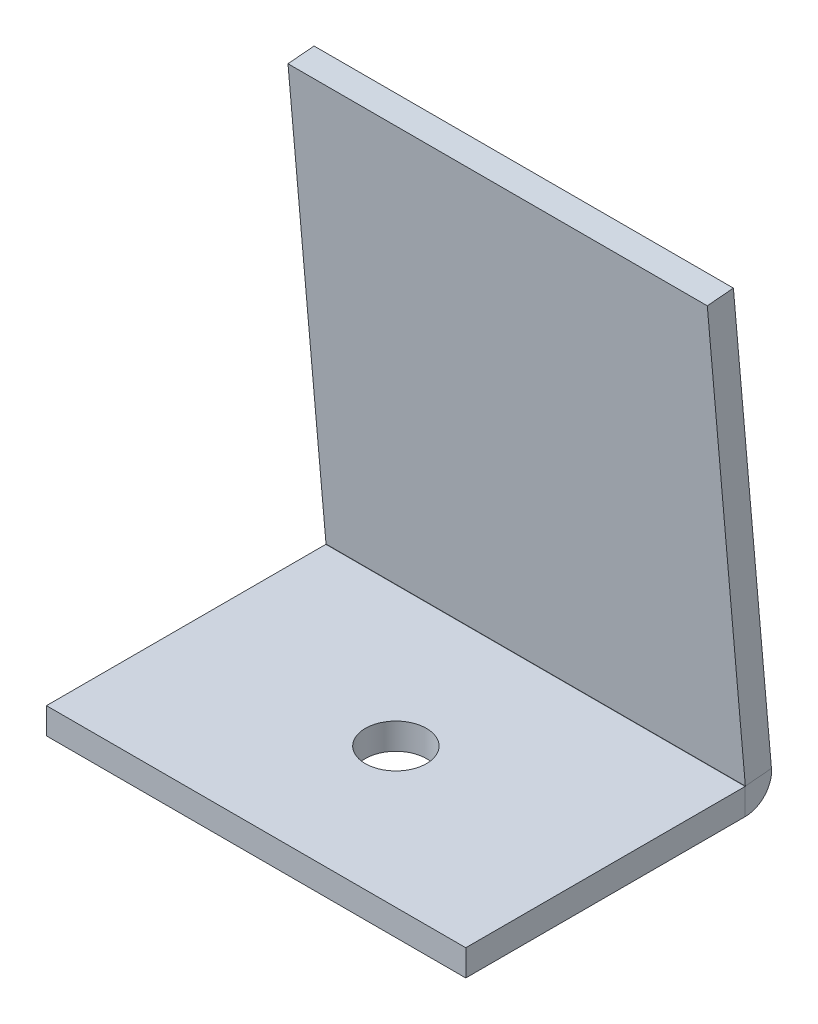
ISO-10303-21;
HEADER;
FILE_DESCRIPTION(('STEP AP214'),'2;1');
FILE_NAME('part.step','',(''),(''),'','','');
FILE_SCHEMA(('AUTOMOTIVE_DESIGN { 1 0 10303 214 1 1 1 1 }'));
ENDSEC;
DATA;
#1=APPLICATION_CONTEXT('core data for automotive mechanical design processes');
#2=APPLICATION_PROTOCOL_DEFINITION('international standard','automotive_design',2000,#1);
#3=PRODUCT_CONTEXT('',#1,'mechanical');
#4=PRODUCT('Part','Part','',(#3));
#5=PRODUCT_RELATED_PRODUCT_CATEGORY('part','',(#4));
#6=PRODUCT_DEFINITION_FORMATION('','',#4);
#7=PRODUCT_DEFINITION_CONTEXT('part definition',#1,'design');
#8=PRODUCT_DEFINITION('design','',#6,#7);
#9=PRODUCT_DEFINITION_SHAPE('','',#8);
#10=(LENGTH_UNIT() NAMED_UNIT(*) SI_UNIT(.MILLI.,.METRE.));
#11=(NAMED_UNIT(*) PLANE_ANGLE_UNIT() SI_UNIT($,.RADIAN.));
#12=(NAMED_UNIT(*) SI_UNIT($,.STERADIAN.) SOLID_ANGLE_UNIT());
#13=UNCERTAINTY_MEASURE_WITH_UNIT(LENGTH_MEASURE(1.E-05),#10,'distance_accuracy_value','');
#14=(GEOMETRIC_REPRESENTATION_CONTEXT(3) GLOBAL_UNCERTAINTY_ASSIGNED_CONTEXT((#13)) GLOBAL_UNIT_ASSIGNED_CONTEXT((#10,
#11,#12)) REPRESENTATION_CONTEXT('',''));
#15=CARTESIAN_POINT('',(0.,0.,0.));
#16=DIRECTION('',(0.,0.,1.));
#17=DIRECTION('',(1.,0.,0.));
#18=AXIS2_PLACEMENT_3D('',#15,#16,#17);
#19=CARTESIAN_POINT('',(24.,-14.4365147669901,-17.396874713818));
#20=DIRECTION('',(-1.,0.,0.));
#21=DIRECTION('',(0.,-0.996194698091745,-0.0871557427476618));
#22=AXIS2_PLACEMENT_3D('',#19,#20,#21);
#23=PLANE('',#22);
#24=DIRECTION('',(0.,0.996194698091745,0.0871557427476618));
#25=VECTOR('',#24,1.);
#26=CARTESIAN_POINT('',(24.,-14.4365147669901,-17.396874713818));
#27=LINE('',#26,#25);
#28=CARTESIAN_POINT('',(24.,1.51087155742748,-16.001659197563));
#29=VERTEX_POINT('',#28);
#30=CARTESIAN_POINT('',(24.,26.4074678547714,-13.8234892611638));
#31=VERTEX_POINT('',#30);
#32=EDGE_CURVE('E100',#29,#31,#27,.T.);
#33=ORIENTED_EDGE('',*,*,#32,.F.);
#34=DIRECTION('',(0.,0.0871557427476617,-0.996194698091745));
#35=VECTOR('',#34,1.);
#36=CARTESIAN_POINT('',(24.,1.51087155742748,-16.001659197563));
#37=LINE('',#36,#35);
#38=CARTESIAN_POINT('',(24.,1.64160517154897,-17.4959512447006));
#39=VERTEX_POINT('',#38);
#40=EDGE_CURVE('E12',#29,#39,#37,.T.);
#41=ORIENTED_EDGE('',*,*,#40,.T.);
#42=DIRECTION('',(0.,0.996194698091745,0.0871557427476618));
#43=VECTOR('',#42,1.);
#44=CARTESIAN_POINT('',(24.,-14.3057811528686,-18.8911667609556));
#45=LINE('',#44,#43);
#46=CARTESIAN_POINT('',(24.,26.5382014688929,-15.3177813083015));
#47=VERTEX_POINT('',#46);
#48=EDGE_CURVE('E84',#39,#47,#45,.T.);
#49=ORIENTED_EDGE('',*,*,#48,.T.);
#50=DIRECTION('',(0.,0.0871557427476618,-0.996194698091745));
#51=VECTOR('',#50,1.);
#52=CARTESIAN_POINT('',(24.,26.4074678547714,-13.8234892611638));
#53=LINE('',#52,#51);
#54=EDGE_CURVE('E80',#31,#47,#53,.T.);
#55=ORIENTED_EDGE('',*,*,#54,.F.);
#56=EDGE_LOOP('',(#33,#41,#49,#55));
#57=FACE_BOUND('',#56,.T.);
#58=ADVANCED_FACE('F37',(#57),#23,.F.);
#59=CARTESIAN_POINT('',(0.,-14.4365147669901,-17.396874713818));
#60=DIRECTION('',(1.,0.,0.));
#61=DIRECTION('',(0.,0.996194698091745,0.0871557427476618));
#62=AXIS2_PLACEMENT_3D('',#59,#60,#61);
#63=PLANE('',#62);
#64=DIRECTION('',(0.,-0.996194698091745,-0.0871557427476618));
#65=VECTOR('',#64,1.);
#66=CARTESIAN_POINT('',(0.,-14.3057811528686,-18.8911667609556));
#67=LINE('',#66,#65);
#68=CARTESIAN_POINT('',(0.,26.5382014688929,-15.3177813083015));
#69=VERTEX_POINT('',#68);
#70=CARTESIAN_POINT('',(0.,1.64160517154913,-17.4959512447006));
#71=VERTEX_POINT('',#70);
#72=EDGE_CURVE('E91',#69,#71,#67,.T.);
#73=ORIENTED_EDGE('',*,*,#72,.T.);
#74=DIRECTION('',(0.,-0.0871557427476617,0.996194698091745));
#75=VECTOR('',#74,1.);
#76=CARTESIAN_POINT('',(0.,1.51087155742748,-16.001659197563));
#77=LINE('',#76,#75);
#78=CARTESIAN_POINT('',(0.,1.51087155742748,-16.001659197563));
#79=VERTEX_POINT('',#78);
#80=EDGE_CURVE('E113',#71,#79,#77,.T.);
#81=ORIENTED_EDGE('',*,*,#80,.T.);
#82=DIRECTION('',(0.,-0.996194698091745,-0.0871557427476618));
#83=VECTOR('',#82,1.);
#84=CARTESIAN_POINT('',(0.,-14.4365147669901,-17.396874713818));
#85=LINE('',#84,#83);
#86=CARTESIAN_POINT('',(0.,26.4074678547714,-13.8234892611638));
#87=VERTEX_POINT('',#86);
#88=EDGE_CURVE('E40',#87,#79,#85,.T.);
#89=ORIENTED_EDGE('',*,*,#88,.F.);
#90=DIRECTION('',(0.,0.0871557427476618,-0.996194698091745));
#91=VECTOR('',#90,1.);
#92=CARTESIAN_POINT('',(0.,26.4074678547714,-13.8234892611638));
#93=LINE('',#92,#91);
#94=EDGE_CURVE('E77',#87,#69,#93,.T.);
#95=ORIENTED_EDGE('',*,*,#94,.T.);
#96=EDGE_LOOP('',(#73,#81,#89,#95));
#97=FACE_BOUND('',#96,.T.);
#98=ADVANCED_FACE('F88',(#97),#63,.F.);
#99=CARTESIAN_POINT('',(0.,26.4074678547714,-13.8234892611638));
#100=DIRECTION('',(0.,0.0871557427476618,-0.996194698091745));
#101=DIRECTION('',(0.,0.996194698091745,0.0871557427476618));
#102=AXIS2_PLACEMENT_3D('',#99,#100,#101);
#103=PLANE('',#102);
#104=ORIENTED_EDGE('',*,*,#88,.T.);
#105=DIRECTION('',(1.,0.,0.));
#106=VECTOR('',#105,1.);
#107=CARTESIAN_POINT('',(0.,1.51087155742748,-16.001659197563));
#108=LINE('',#107,#106);
#109=EDGE_CURVE('E108',#79,#29,#108,.T.);
#110=ORIENTED_EDGE('',*,*,#109,.T.);
#111=ORIENTED_EDGE('',*,*,#32,.T.);
#112=DIRECTION('',(-1.,0.,0.));
#113=VECTOR('',#112,1.);
#114=CARTESIAN_POINT('',(0.,26.4074678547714,-13.8234892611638));
#115=LINE('',#114,#113);
#116=EDGE_CURVE('E61',#31,#87,#115,.T.);
#117=ORIENTED_EDGE('',*,*,#116,.T.);
#118=EDGE_LOOP('',(#104,#110,#111,#117));
#119=FACE_BOUND('',#118,.T.);
#120=ADVANCED_FACE('F105',(#119),#103,.F.);
#121=CARTESIAN_POINT('',(0.,26.5382014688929,-15.3177813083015));
#122=DIRECTION('',(0.,0.0871557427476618,-0.996194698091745));
#123=DIRECTION('',(0.,0.996194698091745,0.0871557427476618));
#124=AXIS2_PLACEMENT_3D('',#121,#122,#123);
#125=PLANE('',#124);
#126=DIRECTION('',(1.,0.,0.));
#127=VECTOR('',#126,1.);
#128=CARTESIAN_POINT('',(0.,1.64160517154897,-17.4959512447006));
#129=LINE('',#128,#127);
#130=EDGE_CURVE('E45',#71,#39,#129,.T.);
#131=ORIENTED_EDGE('',*,*,#130,.F.);
#132=ORIENTED_EDGE('',*,*,#72,.F.);
#133=DIRECTION('',(-1.,0.,0.));
#134=VECTOR('',#133,1.);
#135=CARTESIAN_POINT('',(0.,26.5382014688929,-15.3177813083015));
#136=LINE('',#135,#134);
#137=EDGE_CURVE('E74',#47,#69,#136,.T.);
#138=ORIENTED_EDGE('',*,*,#137,.F.);
#139=ORIENTED_EDGE('',*,*,#48,.F.);
#140=EDGE_LOOP('',(#131,#132,#138,#139));
#141=FACE_BOUND('',#140,.T.);
#142=ADVANCED_FACE('F93',(#141),#125,.T.);
#143=CARTESIAN_POINT('',(0.,26.4074678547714,-13.8234892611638));
#144=DIRECTION('',(0.,-0.996194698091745,-0.0871557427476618));
#145=DIRECTION('',(1.,0.,0.));
#146=AXIS2_PLACEMENT_3D('',#143,#144,#145);
#147=PLANE('',#146);
#148=ORIENTED_EDGE('',*,*,#137,.T.);
#149=ORIENTED_EDGE('',*,*,#94,.F.);
#150=ORIENTED_EDGE('',*,*,#116,.F.);
#151=ORIENTED_EDGE('',*,*,#54,.T.);
#152=EDGE_LOOP('',(#148,#149,#150,#151));
#153=FACE_BOUND('',#152,.T.);
#154=ADVANCED_FACE('F76',(#153),#147,.F.);
#155=CARTESIAN_POINT('',(12.,1.5,-8.));
#156=DIRECTION('',(0.,-1.,0.));
#157=DIRECTION('',(0.,0.,-1.));
#158=AXIS2_PLACEMENT_3D('',#155,#156,#157);
#159=CYLINDRICAL_SURFACE('',#158,1.75);
#160=CARTESIAN_POINT('',(12.,1.5,-8.));
#161=DIRECTION('',(0.,1.,0.));
#162=DIRECTION('',(0.,0.,1.));
#163=AXIS2_PLACEMENT_3D('',#160,#161,#162);
#164=CIRCLE('',#163,1.75);
#165=CARTESIAN_POINT('',(12.,1.5,-6.25));
#166=VERTEX_POINT('',#165);
#167=EDGE_CURVE('E131',#166,#166,#164,.T.);
#168=ORIENTED_EDGE('',*,*,#167,.T.);
#169=EDGE_LOOP('',(#168));
#170=FACE_BOUND('',#169,.T.);
#171=CARTESIAN_POINT('',(12.,0.,-8.));
#172=DIRECTION('',(0.,1.,0.));
#173=DIRECTION('',(0.,0.,1.));
#174=AXIS2_PLACEMENT_3D('',#171,#172,#173);
#175=CIRCLE('',#174,1.75);
#176=CARTESIAN_POINT('',(12.,0.,-6.25));
#177=VERTEX_POINT('',#176);
#178=EDGE_CURVE('E152',#177,#177,#175,.T.);
#179=ORIENTED_EDGE('',*,*,#178,.F.);
#180=EDGE_LOOP('',(#179));
#181=FACE_BOUND('',#180,.T.);
#182=ADVANCED_FACE('F215',(#170,#181),#159,.F.);
#183=CARTESIAN_POINT('',(0.,1.5,0.));
#184=DIRECTION('',(0.,0.,-1.));
#185=DIRECTION('',(-1.,0.,0.));
#186=AXIS2_PLACEMENT_3D('',#183,#184,#185);
#187=PLANE('',#186);
#188=DIRECTION('',(1.,0.,0.));
#189=VECTOR('',#188,1.);
#190=CARTESIAN_POINT('',(0.,0.,0.));
#191=LINE('',#190,#189);
#192=CARTESIAN_POINT('',(0.,0.,0.));
#193=VERTEX_POINT('',#192);
#194=CARTESIAN_POINT('',(24.,0.,0.));
#195=VERTEX_POINT('',#194);
#196=EDGE_CURVE('E134',#193,#195,#191,.T.);
#197=ORIENTED_EDGE('',*,*,#196,.T.);
#198=DIRECTION('',(0.,-1.,0.));
#199=VECTOR('',#198,1.);
#200=CARTESIAN_POINT('',(24.,1.5,0.));
#201=LINE('',#200,#199);
#202=CARTESIAN_POINT('',(24.,1.5,0.));
#203=VERTEX_POINT('',#202);
#204=EDGE_CURVE('E98',#203,#195,#201,.T.);
#205=ORIENTED_EDGE('',*,*,#204,.F.);
#206=DIRECTION('',(1.,0.,0.));
#207=VECTOR('',#206,1.);
#208=CARTESIAN_POINT('',(0.,1.5,0.));
#209=LINE('',#208,#207);
#210=CARTESIAN_POINT('',(0.,1.5,0.));
#211=VERTEX_POINT('',#210);
#212=EDGE_CURVE('E143',#211,#203,#209,.T.);
#213=ORIENTED_EDGE('',*,*,#212,.F.);
#214=DIRECTION('',(0.,-1.,0.));
#215=VECTOR('',#214,1.);
#216=CARTESIAN_POINT('',(0.,1.5,0.));
#217=LINE('',#216,#215);
#218=EDGE_CURVE('E137',#211,#193,#217,.T.);
#219=ORIENTED_EDGE('',*,*,#218,.T.);
#220=EDGE_LOOP('',(#197,#205,#213,#219));
#221=FACE_BOUND('',#220,.T.);
#222=ADVANCED_FACE('F213',(#221),#187,.F.);
#223=CARTESIAN_POINT('',(0.,1.5,-41.));
#224=DIRECTION('',(0.,-1.,0.));
#225=DIRECTION('',(0.,0.,-1.));
#226=AXIS2_PLACEMENT_3D('',#223,#224,#225);
#227=PLANE('',#226);
#228=DIRECTION('',(1.,0.,0.));
#229=VECTOR('',#228,1.);
#230=CARTESIAN_POINT('',(0.,1.5,-15.9916972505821));
#231=LINE('',#230,#229);
#232=CARTESIAN_POINT('',(0.,1.5,-15.9916972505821));
#233=VERTEX_POINT('',#232);
#234=CARTESIAN_POINT('',(24.,1.5,-15.9916972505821));
#235=VERTEX_POINT('',#234);
#236=EDGE_CURVE('E121',#233,#235,#231,.T.);
#237=ORIENTED_EDGE('',*,*,#236,.F.);
#238=DIRECTION('',(0.,0.,1.));
#239=VECTOR('',#238,1.);
#240=CARTESIAN_POINT('',(0.,1.5,0.));
#241=LINE('',#240,#239);
#242=EDGE_CURVE('E140',#233,#211,#241,.T.);
#243=ORIENTED_EDGE('',*,*,#242,.T.);
#244=ORIENTED_EDGE('',*,*,#212,.T.);
#245=DIRECTION('',(0.,0.,-1.));
#246=VECTOR('',#245,1.);
#247=CARTESIAN_POINT('',(24.,1.5,0.));
#248=LINE('',#247,#246);
#249=EDGE_CURVE('E146',#203,#235,#248,.T.);
#250=ORIENTED_EDGE('',*,*,#249,.T.);
#251=EDGE_LOOP('',(#237,#243,#244,#250));
#252=FACE_BOUND('',#251,.T.);
#253=ORIENTED_EDGE('',*,*,#167,.F.);
#254=EDGE_LOOP('',(#253));
#255=FACE_BOUND('',#254,.T.);
#256=ADVANCED_FACE('F210',(#252,#255),#227,.F.);
#257=CARTESIAN_POINT('',(0.,1.5,0.));
#258=DIRECTION('',(1.,0.,0.));
#259=DIRECTION('',(0.,0.,-1.));
#260=AXIS2_PLACEMENT_3D('',#257,#258,#259);
#261=PLANE('',#260);
#262=DIRECTION('',(0.,1.,0.));
#263=VECTOR('',#262,1.);
#264=CARTESIAN_POINT('',(0.,1.5,-15.9916972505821));
#265=LINE('',#264,#263);
#266=CARTESIAN_POINT('',(0.,0.,-15.9916972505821));
#267=VERTEX_POINT('',#266);
#268=EDGE_CURVE('E128',#267,#233,#265,.T.);
#269=ORIENTED_EDGE('',*,*,#268,.F.);
#270=DIRECTION('',(0.,0.,1.));
#271=VECTOR('',#270,1.);
#272=CARTESIAN_POINT('',(0.,0.,0.));
#273=LINE('',#272,#271);
#274=EDGE_CURVE('E149',#267,#193,#273,.T.);
#275=ORIENTED_EDGE('',*,*,#274,.T.);
#276=ORIENTED_EDGE('',*,*,#218,.F.);
#277=ORIENTED_EDGE('',*,*,#242,.F.);
#278=EDGE_LOOP('',(#269,#275,#276,#277));
#279=FACE_BOUND('',#278,.T.);
#280=ADVANCED_FACE('F180',(#279),#261,.F.);
#281=CARTESIAN_POINT('',(0.,0.,-41.));
#282=DIRECTION('',(0.,-1.,0.));
#283=DIRECTION('',(0.,0.,-1.));
#284=AXIS2_PLACEMENT_3D('',#281,#282,#283);
#285=PLANE('',#284);
#286=ORIENTED_EDGE('',*,*,#178,.T.);
#287=EDGE_LOOP('',(#286));
#288=FACE_BOUND('',#287,.T.);
#289=ORIENTED_EDGE('',*,*,#274,.F.);
#290=DIRECTION('',(1.,0.,0.));
#291=VECTOR('',#290,1.);
#292=CARTESIAN_POINT('',(0.,0.,-15.9916972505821));
#293=LINE('',#292,#291);
#294=CARTESIAN_POINT('',(24.,0.,-15.9916972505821));
#295=VERTEX_POINT('',#294);
#296=EDGE_CURVE('E155',#267,#295,#293,.T.);
#297=ORIENTED_EDGE('',*,*,#296,.T.);
#298=DIRECTION('',(0.,0.,-1.));
#299=VECTOR('',#298,1.);
#300=CARTESIAN_POINT('',(24.,0.,0.));
#301=LINE('',#300,#299);
#302=EDGE_CURVE('E94',#195,#295,#301,.T.);
#303=ORIENTED_EDGE('',*,*,#302,.F.);
#304=ORIENTED_EDGE('',*,*,#196,.F.);
#305=EDGE_LOOP('',(#289,#297,#303,#304));
#306=FACE_BOUND('',#305,.T.);
#307=ADVANCED_FACE('F190',(#288,#306),#285,.T.);
#308=CARTESIAN_POINT('',(24.,1.5,0.));
#309=DIRECTION('',(-1.,0.,0.));
#310=DIRECTION('',(0.,0.,1.));
#311=AXIS2_PLACEMENT_3D('',#308,#309,#310);
#312=PLANE('',#311);
#313=DIRECTION('',(0.,-1.,0.));
#314=VECTOR('',#313,1.);
#315=CARTESIAN_POINT('',(24.,1.5,-15.9916972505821));
#316=LINE('',#315,#314);
#317=EDGE_CURVE('E124',#235,#295,#316,.T.);
#318=ORIENTED_EDGE('',*,*,#317,.F.);
#319=ORIENTED_EDGE('',*,*,#249,.F.);
#320=ORIENTED_EDGE('',*,*,#204,.T.);
#321=ORIENTED_EDGE('',*,*,#302,.T.);
#322=EDGE_LOOP('',(#318,#319,#320,#321));
#323=FACE_BOUND('',#322,.T.);
#324=ADVANCED_FACE('F198',(#323),#312,.F.);
#325=CARTESIAN_POINT('',(0.,1.51,-15.9916972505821));
#326=DIRECTION('',(1.,0.,0.));
#327=DIRECTION('',(0.,0.,-1.));
#328=AXIS2_PLACEMENT_3D('',#325,#326,#327);
#329=PLANE('',#328);
#330=ORIENTED_EDGE('',*,*,#80,.F.);
#331=CARTESIAN_POINT('',(0.,1.51,-15.9916972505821));
#332=DIRECTION('',(-1.,0.,0.));
#333=DIRECTION('',(0.,0.,1.));
#334=AXIS2_PLACEMENT_3D('',#331,#332,#333);
#335=CIRCLE('',#334,1.51);
#336=EDGE_CURVE('E160',#71,#267,#335,.T.);
#337=ORIENTED_EDGE('',*,*,#336,.T.);
#338=ORIENTED_EDGE('',*,*,#268,.T.);
#339=CARTESIAN_POINT('',(0.,1.51,-15.9916972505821));
#340=DIRECTION('',(-1.,0.,0.));
#341=DIRECTION('',(0.,0.,1.));
#342=AXIS2_PLACEMENT_3D('',#339,#340,#341);
#343=CIRCLE('',#342,0.00999999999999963);
#344=EDGE_CURVE('E164',#79,#233,#343,.T.);
#345=ORIENTED_EDGE('',*,*,#344,.F.);
#346=EDGE_LOOP('',(#330,#337,#338,#345));
#347=FACE_BOUND('',#346,.T.);
#348=ADVANCED_FACE('F175',(#347),#329,.F.);
#349=CARTESIAN_POINT('',(24.,1.51,-15.9916972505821));
#350=DIRECTION('',(-1.,0.,0.));
#351=DIRECTION('',(0.,0.,1.));
#352=AXIS2_PLACEMENT_3D('',#349,#350,#351);
#353=PLANE('',#352);
#354=ORIENTED_EDGE('',*,*,#317,.T.);
#355=CARTESIAN_POINT('',(24.,1.51,-15.9916972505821));
#356=DIRECTION('',(-1.,0.,0.));
#357=DIRECTION('',(0.,0.,1.));
#358=AXIS2_PLACEMENT_3D('',#355,#356,#357);
#359=CIRCLE('',#358,1.51);
#360=EDGE_CURVE('E162',#295,#39,#359,.F.);
#361=ORIENTED_EDGE('',*,*,#360,.T.);
#362=ORIENTED_EDGE('',*,*,#40,.F.);
#363=CARTESIAN_POINT('',(24.,1.51,-15.9916972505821));
#364=DIRECTION('',(1.,0.,0.));
#365=DIRECTION('',(0.,0.,-1.));
#366=AXIS2_PLACEMENT_3D('',#363,#364,#365);
#367=CIRCLE('',#366,0.00999999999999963);
#368=EDGE_CURVE('E125',#235,#29,#367,.T.);
#369=ORIENTED_EDGE('',*,*,#368,.F.);
#370=EDGE_LOOP('',(#354,#361,#362,#369));
#371=FACE_BOUND('',#370,.T.);
#372=ADVANCED_FACE('F194',(#371),#353,.F.);
#373=CARTESIAN_POINT('',(36.0468350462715,1.51,-15.9916972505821));
#374=DIRECTION('',(-1.,0.,0.));
#375=DIRECTION('',(0.,0.,1.));
#376=AXIS2_PLACEMENT_3D('',#373,#374,#375);
#377=CYLINDRICAL_SURFACE('',#376,0.01);
#378=ORIENTED_EDGE('',*,*,#368,.T.);
#379=ORIENTED_EDGE('',*,*,#109,.F.);
#380=ORIENTED_EDGE('',*,*,#344,.T.);
#381=ORIENTED_EDGE('',*,*,#236,.T.);
#382=EDGE_LOOP('',(#378,#379,#380,#381));
#383=FACE_BOUND('',#382,.T.);
#384=ADVANCED_FACE('F169',(#383),#377,.F.);
#385=CARTESIAN_POINT('',(36.0468350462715,1.51,-15.9916972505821));
#386=DIRECTION('',(-1.,0.,0.));
#387=DIRECTION('',(0.,0.,1.));
#388=AXIS2_PLACEMENT_3D('',#385,#386,#387);
#389=CYLINDRICAL_SURFACE('',#388,1.51);
#390=ORIENTED_EDGE('',*,*,#360,.F.);
#391=ORIENTED_EDGE('',*,*,#296,.F.);
#392=ORIENTED_EDGE('',*,*,#336,.F.);
#393=ORIENTED_EDGE('',*,*,#130,.T.);
#394=EDGE_LOOP('',(#390,#391,#392,#393));
#395=FACE_BOUND('',#394,.T.);
#396=ADVANCED_FACE('F187',(#395),#389,.T.);
#397=CLOSED_SHELL('',(#58,#98,#120,#142,#154,#182,#222,#256,#280,#307,#324,#348,#372,#384,#396));
#398=MANIFOLD_SOLID_BREP('B2',#397);
#399=ADVANCED_BREP_SHAPE_REPRESENTATION('',(#18,#398),#14);
#400=SHAPE_DEFINITION_REPRESENTATION(#9,#399);
ENDSEC;
END-ISO-10303-21;
